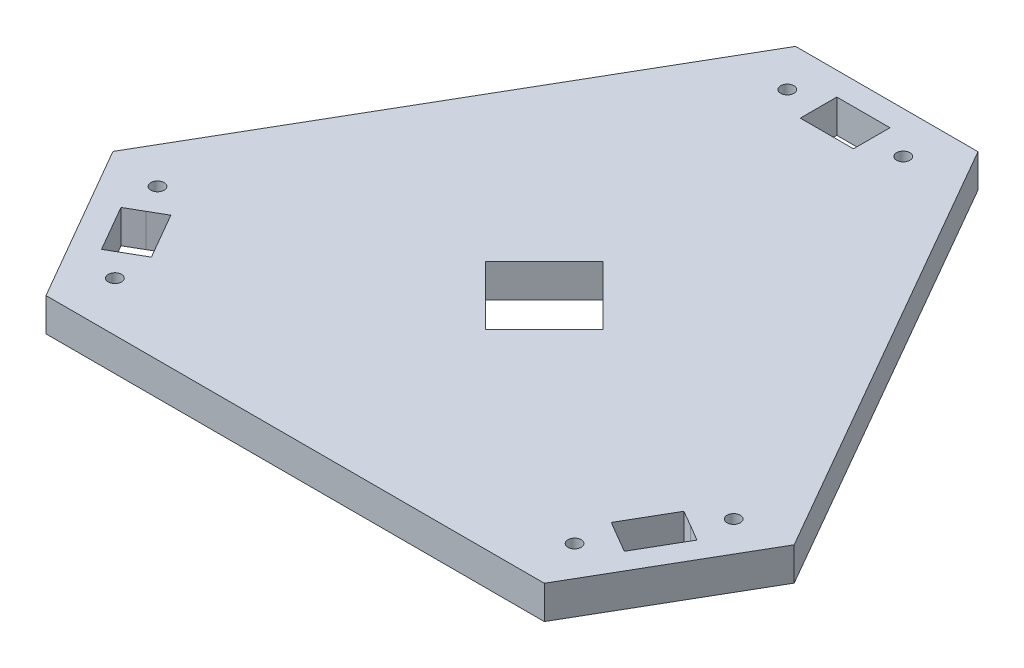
from build123d import *

# Parameters (mm, degrees)
AUFSATZ_LINEAR_AUSTRAGEN1_DEPTH  = 20
SCHNITT_LINEAR_AUSTRAGEN7_DEPTH  = 20
SCHNITT_LINEAR_AUSTRAGEN8_DEPTH  = 20
SCHNITT_LINEAR_AUSTRAGEN9_DEPTH  = 20
SKIZZE2_R                        = 4
SCHNITT_LINEAR_AUSTRAGEN10_DEPTH = 10
SKIZZE4_R                        = 4
SCHNITT_LINEAR_AUSTRAGEN11_DEPTH = 10
SKIZZE5_R                        = 4
SCHNITT_LINEAR_AUSTRAGEN12_DEPTH = 10
SCHNITT_LINEAR_AUSTRAGEN15_DEPTH = 20


with BuildPart() as part:
    # Skizze1 → Aufsatz-Linear austragen1 (new body)
    with BuildSketch(Plane(origin=(0, 0, 0), x_dir=(1, 0, 0), z_dir=(0, 1, 0))):
        Polygon((-149.988554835, 0), (150.075497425, 0), (205.218263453, 95.301404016), (55.58434216, 355.613027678), (-54.237176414, 355.613027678), (-204.994277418, 95.301404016), align=None)
    extrude(amount=AUFSATZ_LINEAR_AUSTRAGEN1_DEPTH)

    # Skizze7 → Schnitt-Linear austragen7 (cut)
    with BuildSketch(Plane(origin=(0, 20, 0), x_dir=(1, 0, 0), z_dir=(0, 1, 0))):
        Polygon((-163.846416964, 74.021047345), (-173.373413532, 68.522289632), (-157.377027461, 40.807390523), (-147.831885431, 46.274709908), (-138.304888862, 51.77346762), (-154.301274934, 79.48836673), align=None)
    extrude(amount=-SCHNITT_LINEAR_AUSTRAGEN7_DEPTH, mode=Mode.SUBTRACT)

    # Skizze8 → Schnitt-Linear austragen8 (cut)
    with BuildSketch(Plane(origin=(0, 20, 0), x_dir=(1, 0, 0), z_dir=(0, 1, 0))):
        Polygon((164.047486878, 74.065416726), (154.526423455, 79.574441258), (138.50017027, 51.876802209), (147.968712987, 46.277007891), (157.489776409, 40.767983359), (173.516029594, 68.465622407), align=None)
    extrude(amount=-SCHNITT_LINEAR_AUSTRAGEN8_DEPTH, mode=Mode.SUBTRACT)

    # Skizze11 → Schnitt-Linear austragen9 (cut)
    with BuildSketch(Plane(origin=(0, 20, 0), x_dir=(1, 0, 0), z_dir=(0, 1, 0))):
        Polygon((-15.41565784, 330.613027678), (-15.41565784, 319.613027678), (16.58434216, 319.613027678), (16.58434216, 341.613027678), (-15.41565784, 341.613027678), align=None)
    extrude(amount=-SCHNITT_LINEAR_AUSTRAGEN9_DEPTH, mode=Mode.SUBTRACT)

    # Skizze2 → Schnitt-Linear austragen10 (cut)
    with BuildSketch(Plane(origin=(0, 20, 0), x_dir=(1, 0, 0), z_dir=(0, 1, 0))):
        with Locations(Location((173.563074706, 90.510889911, 0), (0, 0, 270))):
            Circle(SKIZZE2_R)
        with Locations(Location((138.453125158, 29.831534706, 0), (0, 0, 270))):
            Circle(SKIZZE2_R)
    extrude(amount=-SCHNITT_LINEAR_AUSTRAGEN10_DEPTH, mode=Mode.SUBTRACT)

    # Skizze4 → Schnitt-Linear austragen11 (cut)
    with BuildSketch(Plane(origin=(0, 20, 0), x_dir=(1, 0, 0), z_dir=(0, 1, 0))):
        with Locations(Location((-34.237176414, 330.613027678, 0), (0, 0, 270))):
            Circle(SKIZZE4_R)
        with Locations(Location((35.58434216, 330.613027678, 0), (0, 0, 270))):
            Circle(SKIZZE4_R)
    extrude(amount=-SCHNITT_LINEAR_AUSTRAGEN11_DEPTH, mode=Mode.SUBTRACT)

    # Skizze5 → Schnitt-Linear austragen12 (cut)
    with BuildSketch(Plane(origin=(0, 20, 0), x_dir=(1, 0, 0), z_dir=(0, 1, 0))):
        with Locations(Location((-173.344271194, 90.476768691, 0), (0, 0, 270))):
            Circle(SKIZZE5_R)
        with Locations(Location((-138.334031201, 29.818988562, 0), (0, 0, 270))):
            Circle(SKIZZE5_R)
    extrude(amount=-SCHNITT_LINEAR_AUSTRAGEN12_DEPTH, mode=Mode.SUBTRACT)

    # Skizze16 → Schnitt-Linear austragen15 (cut)
    with BuildSketch(Plane(origin=(0, 20, 0), x_dir=(1, 0, 0), z_dir=(0, 1, 0))):
        Polygon((0, 114.796112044), (-35.355, 150.151112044), (0, 185.506112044), (35.355, 150.151112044), align=None)
    extrude(amount=-SCHNITT_LINEAR_AUSTRAGEN15_DEPTH, mode=Mode.SUBTRACT)


solid = part.part
